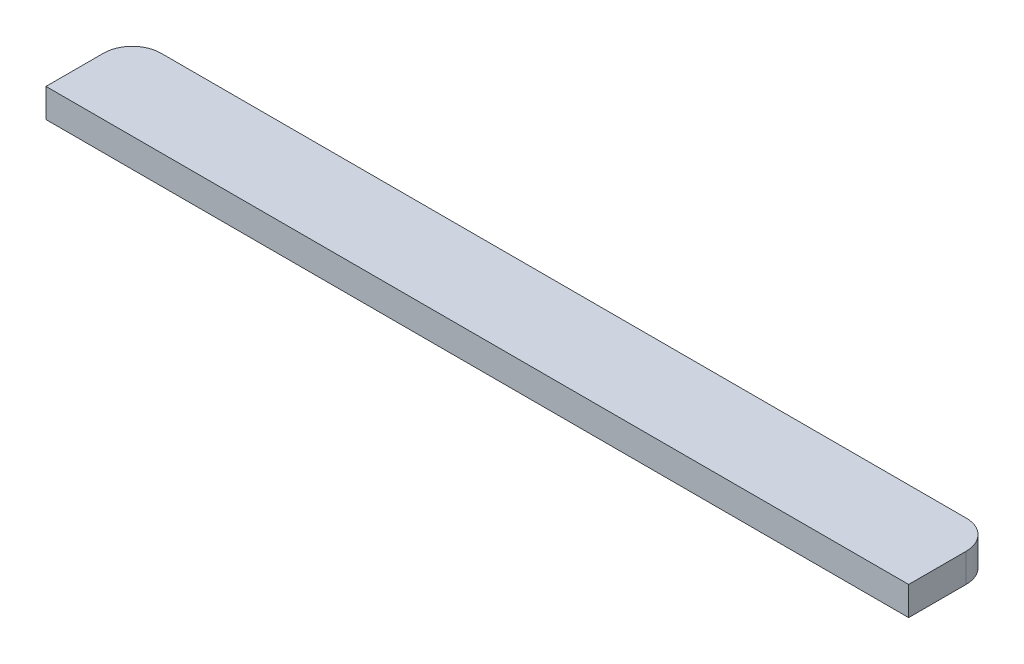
from build123d import *

# Parameters (mm, degrees)
SKETCH2_W      = 190.5
SKETCH2_H      = 6.35
EXTRUDE2_DEPTH = 19.05
FILLET1_R      = 6.35


with BuildPart() as part:
    # Sketch2 → Extrude2 (new body)
    with BuildSketch(Plane(origin=(0, 0, 0), x_dir=(-1, 0, 0), z_dir=(0, 0, -1))):
        with Locations((95.25, 3.175)):
            Rectangle(SKETCH2_W, SKETCH2_H)
    extrude(amount=EXTRUDE2_DEPTH)

    # Fillet1
    fillet1_edges = [part.edges().sort_by_distance(p)[0] for p in [
        (-190.5, 3.175, -19.05),
        (0, 3.175, -19.05),
    ]]
    fillet(fillet1_edges, radius=FILLET1_R)


solid = part.part
